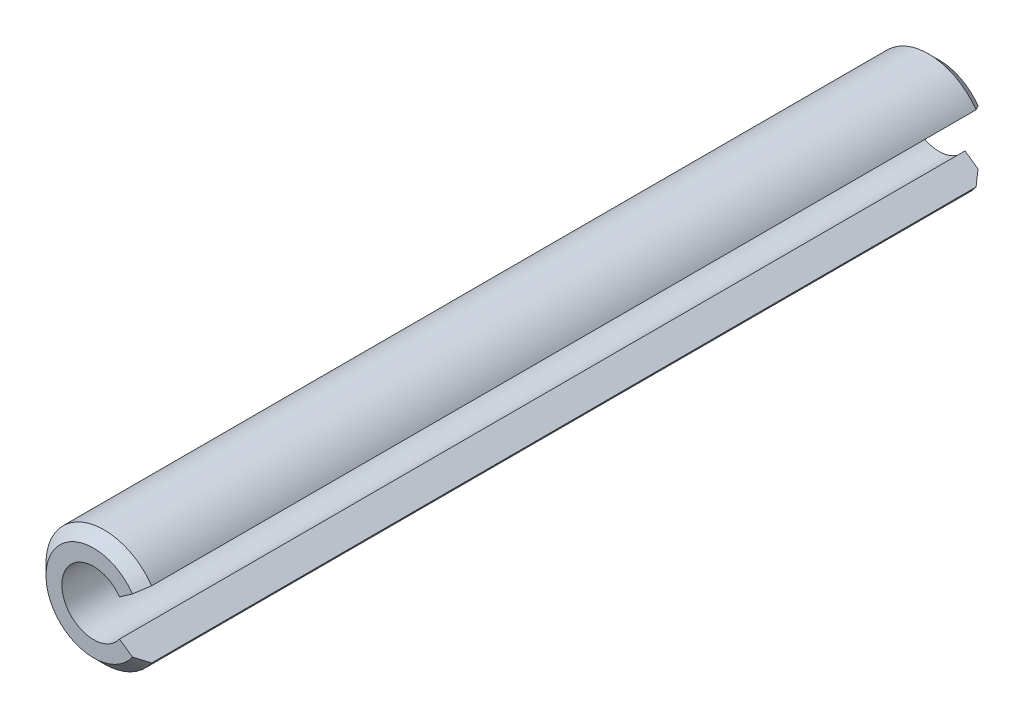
from build123d import *

# Parameters (mm, degrees)
EXTRUSION1_DEPTH = 16
CHANFREIN1_SIZE  = 0.2


with BuildPart() as part:
    # Esquisse1 → Extrusion1 (new body)
    with BuildSketch(Plane.XY):
        with BuildLine():
            Line((0.9, -0.632455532), (0.490909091, -0.344975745))
            ThreePointArc((0.490909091, -0.344975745), (-0.6, 0), (0.490909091, 0.344975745))
            Line((0.490909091, 0.344975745), (0.9, 0.632455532))
            ThreePointArc((0.9, 0.632455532), (-1.1, 0), (0.9, -0.632455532))
        make_face()
    extrude(amount=EXTRUSION1_DEPTH)

    # Chanfrein1
    chanfrein1_edges = [part.edges().sort_by_distance(p)[0] for p in [
        (-1.1, 0, 16),
        (-1.1, 0, 0),
    ]]
    chamfer(chanfrein1_edges, length=CHANFREIN1_SIZE)


solid = part.part
